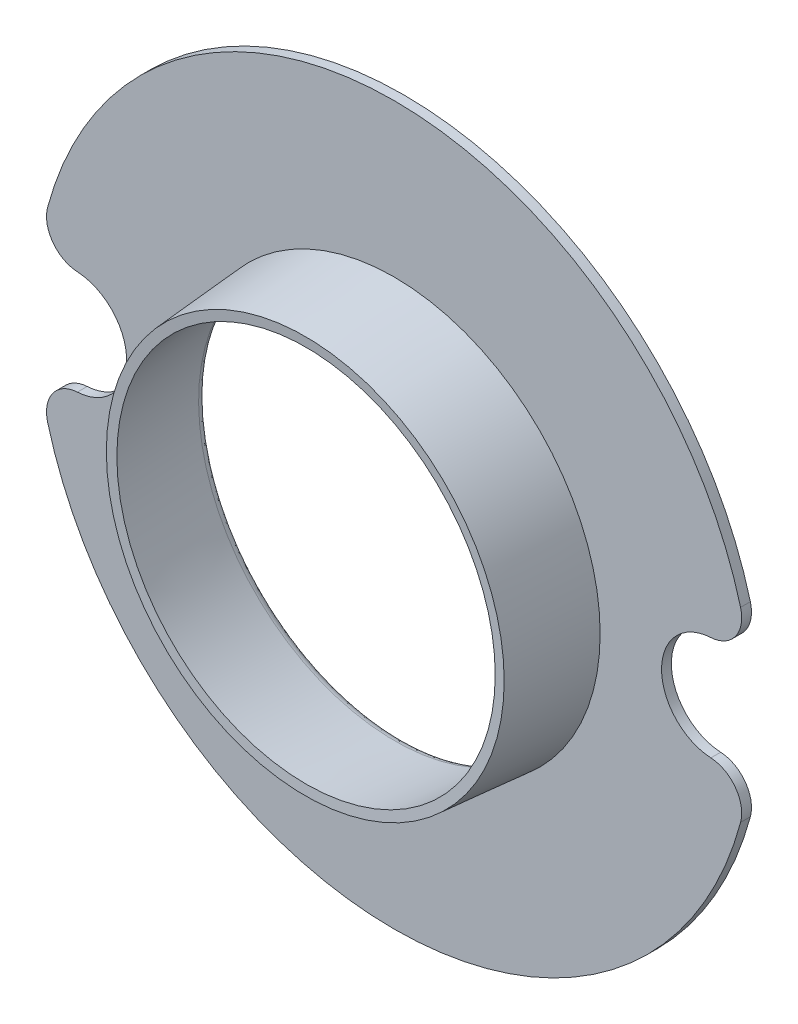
ISO-10303-21;
HEADER;
FILE_DESCRIPTION(('STEP AP214'),'2;1');
FILE_NAME('part.step','',(''),(''),'','','');
FILE_SCHEMA(('AUTOMOTIVE_DESIGN { 1 0 10303 214 1 1 1 1 }'));
ENDSEC;
DATA;
#1=APPLICATION_CONTEXT('core data for automotive mechanical design processes');
#2=APPLICATION_PROTOCOL_DEFINITION('international standard','automotive_design',2000,#1);
#3=PRODUCT_CONTEXT('',#1,'mechanical');
#4=PRODUCT('Part','Part','',(#3));
#5=PRODUCT_RELATED_PRODUCT_CATEGORY('part','',(#4));
#6=PRODUCT_DEFINITION_FORMATION('','',#4);
#7=PRODUCT_DEFINITION_CONTEXT('part definition',#1,'design');
#8=PRODUCT_DEFINITION('design','',#6,#7);
#9=PRODUCT_DEFINITION_SHAPE('','',#8);
#10=(LENGTH_UNIT() NAMED_UNIT(*) SI_UNIT(.MILLI.,.METRE.));
#11=(NAMED_UNIT(*) PLANE_ANGLE_UNIT() SI_UNIT($,.RADIAN.));
#12=(NAMED_UNIT(*) SI_UNIT($,.STERADIAN.) SOLID_ANGLE_UNIT());
#13=UNCERTAINTY_MEASURE_WITH_UNIT(LENGTH_MEASURE(1.E-05),#10,'distance_accuracy_value','');
#14=(GEOMETRIC_REPRESENTATION_CONTEXT(3) GLOBAL_UNCERTAINTY_ASSIGNED_CONTEXT((#13)) GLOBAL_UNIT_ASSIGNED_CONTEXT((#10,
#11,#12)) REPRESENTATION_CONTEXT('',''));
#15=CARTESIAN_POINT('',(0.,0.,0.));
#16=DIRECTION('',(0.,0.,1.));
#17=DIRECTION('',(1.,0.,0.));
#18=AXIS2_PLACEMENT_3D('',#15,#16,#17);
#19=CARTESIAN_POINT('',(0.,0.,21.0119617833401));
#20=DIRECTION('',(0.,0.,-1.));
#21=DIRECTION('',(-1.,0.,0.));
#22=AXIS2_PLACEMENT_3D('',#19,#20,#21);
#23=CONICAL_SURFACE('',#22,3.04952229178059,0.0798299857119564);
#24=CARTESIAN_POINT('',(0.,0.,21.0119617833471));
#25=DIRECTION('',(0.,0.,-1.));
#26=DIRECTION('',(1.,0.,0.));
#27=AXIS2_PLACEMENT_3D('',#24,#25,#26);
#28=CIRCLE('',#27,3.04952229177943);
#29=CARTESIAN_POINT('',(3.04952229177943,0.,21.0119617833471));
#30=VERTEX_POINT('',#29);
#31=EDGE_CURVE('E96',#30,#30,#28,.T.);
#32=ORIENTED_EDGE('',*,*,#31,.T.);
#33=EDGE_LOOP('',(#32));
#34=FACE_BOUND('',#33,.T.);
#35=CARTESIAN_POINT('',(0.,0.,19.65));
#36=DIRECTION('',(0.,0.,-1.));
#37=DIRECTION('',(-1.,0.,0.));
#38=AXIS2_PLACEMENT_3D('',#35,#36,#37);
#39=CIRCLE('',#38,3.15847923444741);
#40=CARTESIAN_POINT('',(-3.15847923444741,0.,19.65));
#41=VERTEX_POINT('',#40);
#42=EDGE_CURVE('E95',#41,#41,#39,.F.);
#43=ORIENTED_EDGE('',*,*,#42,.T.);
#44=EDGE_LOOP('',(#43));
#45=FACE_BOUND('',#44,.T.);
#46=ADVANCED_FACE('F16',(#34,#45),#23,.T.);
#47=CARTESIAN_POINT('',(0.,0.,21.0119617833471));
#48=DIRECTION('',(0.,0.,1.));
#49=DIRECTION('',(1.,0.,0.));
#50=AXIS2_PLACEMENT_3D('',#47,#48,#49);
#51=CONICAL_SURFACE('',#50,3.04952229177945,1.49096634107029);
#52=CARTESIAN_POINT('',(0.,0.,21.));
#53=DIRECTION('',(0.,0.,-1.));
#54=DIRECTION('',(1.,0.,0.));
#55=AXIS2_PLACEMENT_3D('',#52,#53,#54);
#56=CIRCLE('',#55,2.89999999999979);
#57=CARTESIAN_POINT('',(2.89999999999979,0.,21.));
#58=VERTEX_POINT('',#57);
#59=EDGE_CURVE('E139',#58,#58,#56,.T.);
#60=ORIENTED_EDGE('',*,*,#59,.T.);
#61=EDGE_LOOP('',(#60));
#62=FACE_BOUND('',#61,.T.);
#63=ORIENTED_EDGE('',*,*,#31,.F.);
#64=EDGE_LOOP('',(#63));
#65=FACE_BOUND('',#64,.T.);
#66=ADVANCED_FACE('F190',(#62,#65),#51,.F.);
#67=CARTESIAN_POINT('',(-5.541827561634,5.72,19.65));
#68=DIRECTION('',(0.,0.,-1.));
#69=DIRECTION('',(1.,0.,0.));
#70=AXIS2_PLACEMENT_3D('',#67,#68,#69);
#71=PLANE('',#70);
#72=ORIENTED_EDGE('',*,*,#42,.F.);
#73=EDGE_LOOP('',(#72));
#74=FACE_BOUND('',#73,.T.);
#75=CARTESIAN_POINT('',(4.9,0.,19.65));
#76=DIRECTION('',(0.,0.,1.));
#77=DIRECTION('',(1.,0.,0.));
#78=AXIS2_PLACEMENT_3D('',#75,#76,#77);
#79=CIRCLE('',#78,0.799999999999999);
#80=CARTESIAN_POINT('',(4.85604395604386,-0.798791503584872,19.65));
#81=VERTEX_POINT('',#80);
#82=CARTESIAN_POINT('',(4.85604395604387,0.798791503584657,19.65));
#83=VERTEX_POINT('',#82);
#84=EDGE_CURVE('E99',#81,#83,#79,.F.);
#85=ORIENTED_EDGE('',*,*,#84,.T.);
#86=CARTESIAN_POINT('',(4.828571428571,1.298036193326,19.65));
#87=DIRECTION('',(0.,0.,-1.));
#88=DIRECTION('',(0.,1.,0.));
#89=AXIS2_PLACEMENT_3D('',#86,#87,#88);
#90=CIRCLE('',#89,0.500000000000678);
#91=CARTESIAN_POINT('',(5.31142857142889,1.42783981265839,19.65));
#92=VERTEX_POINT('',#91);
#93=EDGE_CURVE('E84',#92,#83,#90,.T.);
#94=ORIENTED_EDGE('',*,*,#93,.F.);
#95=CARTESIAN_POINT('',(0.,0.,19.65));
#96=DIRECTION('',(0.,0.,-1.));
#97=DIRECTION('',(0.,1.,0.));
#98=AXIS2_PLACEMENT_3D('',#95,#96,#97);
#99=CIRCLE('',#98,5.5);
#100=CARTESIAN_POINT('',(-5.31142857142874,1.42783981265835,19.65));
#101=VERTEX_POINT('',#100);
#102=EDGE_CURVE('E142',#92,#101,#99,.F.);
#103=ORIENTED_EDGE('',*,*,#102,.T.);
#104=CARTESIAN_POINT('',(-4.828571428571,1.298036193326,19.65));
#105=DIRECTION('',(0.,0.,1.));
#106=DIRECTION('',(1.,0.,0.));
#107=AXIS2_PLACEMENT_3D('',#104,#105,#106);
#108=CIRCLE('',#107,0.500000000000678);
#109=CARTESIAN_POINT('',(-4.85604395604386,0.798791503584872,19.65));
#110=VERTEX_POINT('',#109);
#111=EDGE_CURVE('E135',#101,#110,#108,.T.);
#112=ORIENTED_EDGE('',*,*,#111,.T.);
#113=CARTESIAN_POINT('',(-4.9,0.,19.65));
#114=DIRECTION('',(0.,0.,-1.));
#115=DIRECTION('',(0.,1.,0.));
#116=AXIS2_PLACEMENT_3D('',#113,#114,#115);
#117=CIRCLE('',#116,0.799999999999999);
#118=CARTESIAN_POINT('',(-4.85604395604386,-0.798791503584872,19.65));
#119=VERTEX_POINT('',#118);
#120=EDGE_CURVE('E128',#110,#119,#117,.T.);
#121=ORIENTED_EDGE('',*,*,#120,.T.);
#122=CARTESIAN_POINT('',(-4.828571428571,-1.298036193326,19.65));
#123=DIRECTION('',(0.,0.,-1.));
#124=DIRECTION('',(0.,1.,0.));
#125=AXIS2_PLACEMENT_3D('',#122,#123,#124);
#126=CIRCLE('',#125,0.500000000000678);
#127=CARTESIAN_POINT('',(-5.31142857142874,-1.42783981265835,19.65));
#128=VERTEX_POINT('',#127);
#129=EDGE_CURVE('E127',#119,#128,#126,.F.);
#130=ORIENTED_EDGE('',*,*,#129,.T.);
#131=CARTESIAN_POINT('',(0.,0.,19.65));
#132=DIRECTION('',(0.,0.,-1.));
#133=DIRECTION('',(0.,1.,0.));
#134=AXIS2_PLACEMENT_3D('',#131,#132,#133);
#135=CIRCLE('',#134,5.5);
#136=CARTESIAN_POINT('',(5.31142857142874,-1.42783981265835,19.65));
#137=VERTEX_POINT('',#136);
#138=EDGE_CURVE('E123',#128,#137,#135,.F.);
#139=ORIENTED_EDGE('',*,*,#138,.T.);
#140=CARTESIAN_POINT('',(4.828571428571,-1.298036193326,19.65));
#141=DIRECTION('',(0.,0.,1.));
#142=DIRECTION('',(1.,0.,0.));
#143=AXIS2_PLACEMENT_3D('',#140,#141,#142);
#144=CIRCLE('',#143,0.500000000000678);
#145=EDGE_CURVE('E102',#137,#81,#144,.T.);
#146=ORIENTED_EDGE('',*,*,#145,.T.);
#147=EDGE_LOOP('',(#85,#94,#103,#112,#121,#130,#139,#146));
#148=FACE_BOUND('',#147,.T.);
#149=ADVANCED_FACE('F100',(#74,#148),#71,.F.);
#150=CARTESIAN_POINT('',(0.,0.,21.));
#151=DIRECTION('',(0.,0.,-1.));
#152=DIRECTION('',(-1.,0.,0.));
#153=AXIS2_PLACEMENT_3D('',#150,#151,#152);
#154=CONICAL_SURFACE('',#153,2.89999999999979,0.0798299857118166);
#155=ORIENTED_EDGE('',*,*,#59,.F.);
#156=EDGE_LOOP('',(#155));
#157=FACE_BOUND('',#156,.T.);
#158=CARTESIAN_POINT('',(0.,0.,19.63803822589));
#159=DIRECTION('',(0.,0.,-1.));
#160=DIRECTION('',(-0.999963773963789,-0.00851180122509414,0.));
#161=AXIS2_PLACEMENT_3D('',#158,#159,#160);
#162=CIRCLE('',#161,3.0089569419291);
#163=CARTESIAN_POINT('',(-3.00884793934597,-0.0256116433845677,19.63803822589));
#164=VERTEX_POINT('',#163);
#165=EDGE_CURVE('E112',#164,#164,#162,.T.);
#166=ORIENTED_EDGE('',*,*,#165,.T.);
#167=EDGE_LOOP('',(#166));
#168=FACE_BOUND('',#167,.T.);
#169=ADVANCED_FACE('F189',(#157,#168),#154,.F.);
#170=CARTESIAN_POINT('',(0.,0.,19.65));
#171=DIRECTION('',(0.,0.,-1.));
#172=DIRECTION('',(0.,1.,0.));
#173=AXIS2_PLACEMENT_3D('',#170,#171,#172);
#174=CYLINDRICAL_SURFACE('',#173,5.5);
#175=CARTESIAN_POINT('',(0.,0.,19.5));
#176=DIRECTION('',(0.,0.,-1.));
#177=DIRECTION('',(0.,1.,0.));
#178=AXIS2_PLACEMENT_3D('',#175,#176,#177);
#179=CIRCLE('',#178,5.5);
#180=CARTESIAN_POINT('',(5.31142857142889,1.42783981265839,19.5));
#181=VERTEX_POINT('',#180);
#182=CARTESIAN_POINT('',(-5.31142857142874,1.42783981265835,19.5));
#183=VERTEX_POINT('',#182);
#184=EDGE_CURVE('E138',#181,#183,#179,.F.);
#185=ORIENTED_EDGE('',*,*,#184,.T.);
#186=DIRECTION('',(0.,0.,1.));
#187=VECTOR('',#186,1.);
#188=CARTESIAN_POINT('',(-5.311428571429,1.427839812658,19.575));
#189=LINE('',#188,#187);
#190=EDGE_CURVE('E132',#183,#101,#189,.T.);
#191=ORIENTED_EDGE('',*,*,#190,.T.);
#192=ORIENTED_EDGE('',*,*,#102,.F.);
#193=DIRECTION('',(0.,0.,-1.));
#194=VECTOR('',#193,1.);
#195=CARTESIAN_POINT('',(5.311428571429,1.427839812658,19.575));
#196=LINE('',#195,#194);
#197=EDGE_CURVE('E94',#92,#181,#196,.T.);
#198=ORIENTED_EDGE('',*,*,#197,.T.);
#199=EDGE_LOOP('',(#185,#191,#192,#198));
#200=FACE_BOUND('',#199,.T.);
#201=ADVANCED_FACE('F196',(#200),#174,.T.);
#202=CARTESIAN_POINT('',(-4.828571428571,1.298036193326,19.5));
#203=DIRECTION('',(0.,0.,1.));
#204=DIRECTION('',(1.,0.,0.));
#205=AXIS2_PLACEMENT_3D('',#202,#203,#204);
#206=CYLINDRICAL_SURFACE('',#205,0.500000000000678);
#207=CARTESIAN_POINT('',(-4.828571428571,1.298036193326,19.5));
#208=DIRECTION('',(0.,0.,1.));
#209=DIRECTION('',(1.,0.,0.));
#210=AXIS2_PLACEMENT_3D('',#207,#208,#209);
#211=CIRCLE('',#210,0.500000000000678);
#212=CARTESIAN_POINT('',(-4.85604395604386,0.798791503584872,19.5));
#213=VERTEX_POINT('',#212);
#214=EDGE_CURVE('E175',#183,#213,#211,.T.);
#215=ORIENTED_EDGE('',*,*,#214,.T.);
#216=DIRECTION('',(0.,0.,-1.));
#217=VECTOR('',#216,1.);
#218=CARTESIAN_POINT('',(-4.856043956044,0.798791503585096,19.575));
#219=LINE('',#218,#217);
#220=EDGE_CURVE('E129',#213,#110,#219,.F.);
#221=ORIENTED_EDGE('',*,*,#220,.T.);
#222=ORIENTED_EDGE('',*,*,#111,.F.);
#223=ORIENTED_EDGE('',*,*,#190,.F.);
#224=EDGE_LOOP('',(#215,#221,#222,#223));
#225=FACE_BOUND('',#224,.T.);
#226=ADVANCED_FACE('F217',(#225),#206,.T.);
#227=CARTESIAN_POINT('',(-4.9,0.,19.65));
#228=DIRECTION('',(0.,0.,-1.));
#229=DIRECTION('',(0.,1.,0.));
#230=AXIS2_PLACEMENT_3D('',#227,#228,#229);
#231=CYLINDRICAL_SURFACE('',#230,0.799999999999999);
#232=DIRECTION('',(0.,0.,1.));
#233=VECTOR('',#232,1.);
#234=CARTESIAN_POINT('',(-4.85604395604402,-0.798791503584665,19.575));
#235=LINE('',#234,#233);
#236=CARTESIAN_POINT('',(-4.85604395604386,-0.798791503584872,19.5));
#237=VERTEX_POINT('',#236);
#238=EDGE_CURVE('E124',#237,#119,#235,.T.);
#239=ORIENTED_EDGE('',*,*,#238,.T.);
#240=ORIENTED_EDGE('',*,*,#120,.F.);
#241=ORIENTED_EDGE('',*,*,#220,.F.);
#242=CARTESIAN_POINT('',(-4.9,0.,19.5));
#243=DIRECTION('',(0.,0.,-1.));
#244=DIRECTION('',(0.,1.,0.));
#245=AXIS2_PLACEMENT_3D('',#242,#243,#244);
#246=CIRCLE('',#245,0.799999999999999);
#247=EDGE_CURVE('E173',#213,#237,#246,.T.);
#248=ORIENTED_EDGE('',*,*,#247,.T.);
#249=EDGE_LOOP('',(#239,#240,#241,#248));
#250=FACE_BOUND('',#249,.T.);
#251=ADVANCED_FACE('F223',(#250),#231,.F.);
#252=CARTESIAN_POINT('',(-4.828571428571,-1.298036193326,19.65));
#253=DIRECTION('',(0.,0.,-1.));
#254=DIRECTION('',(0.,1.,0.));
#255=AXIS2_PLACEMENT_3D('',#252,#253,#254);
#256=CYLINDRICAL_SURFACE('',#255,0.500000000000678);
#257=ORIENTED_EDGE('',*,*,#129,.F.);
#258=ORIENTED_EDGE('',*,*,#238,.F.);
#259=CARTESIAN_POINT('',(-4.828571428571,-1.298036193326,19.5));
#260=DIRECTION('',(0.,0.,-1.));
#261=DIRECTION('',(0.,1.,0.));
#262=AXIS2_PLACEMENT_3D('',#259,#260,#261);
#263=CIRCLE('',#262,0.500000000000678);
#264=CARTESIAN_POINT('',(-5.31142857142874,-1.42783981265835,19.5));
#265=VERTEX_POINT('',#264);
#266=EDGE_CURVE('E171',#237,#265,#263,.F.);
#267=ORIENTED_EDGE('',*,*,#266,.T.);
#268=DIRECTION('',(0.,0.,1.));
#269=VECTOR('',#268,1.);
#270=CARTESIAN_POINT('',(-5.31142857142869,-1.42783981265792,19.575));
#271=LINE('',#270,#269);
#272=EDGE_CURVE('E120',#265,#128,#271,.T.);
#273=ORIENTED_EDGE('',*,*,#272,.T.);
#274=EDGE_LOOP('',(#257,#258,#267,#273));
#275=FACE_BOUND('',#274,.T.);
#276=ADVANCED_FACE('F226',(#275),#256,.T.);
#277=CARTESIAN_POINT('',(0.,0.,19.65));
#278=DIRECTION('',(0.,0.,-1.));
#279=DIRECTION('',(0.,1.,0.));
#280=AXIS2_PLACEMENT_3D('',#277,#278,#279);
#281=CYLINDRICAL_SURFACE('',#280,5.5);
#282=CARTESIAN_POINT('',(0.,0.,19.5));
#283=DIRECTION('',(0.,0.,-1.));
#284=DIRECTION('',(0.,1.,0.));
#285=AXIS2_PLACEMENT_3D('',#282,#283,#284);
#286=CIRCLE('',#285,5.5);
#287=CARTESIAN_POINT('',(5.31142857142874,-1.42783981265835,19.5));
#288=VERTEX_POINT('',#287);
#289=EDGE_CURVE('E169',#265,#288,#286,.F.);
#290=ORIENTED_EDGE('',*,*,#289,.T.);
#291=DIRECTION('',(0.,0.,1.));
#292=VECTOR('',#291,1.);
#293=CARTESIAN_POINT('',(5.311428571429,-1.427839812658,19.575));
#294=LINE('',#293,#292);
#295=EDGE_CURVE('E117',#288,#137,#294,.T.);
#296=ORIENTED_EDGE('',*,*,#295,.T.);
#297=ORIENTED_EDGE('',*,*,#138,.F.);
#298=ORIENTED_EDGE('',*,*,#272,.F.);
#299=EDGE_LOOP('',(#290,#296,#297,#298));
#300=FACE_BOUND('',#299,.T.);
#301=ADVANCED_FACE('F230',(#300),#281,.T.);
#302=CARTESIAN_POINT('',(4.828571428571,-1.298036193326,19.5));
#303=DIRECTION('',(0.,0.,1.));
#304=DIRECTION('',(1.,0.,0.));
#305=AXIS2_PLACEMENT_3D('',#302,#303,#304);
#306=CYLINDRICAL_SURFACE('',#305,0.500000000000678);
#307=CARTESIAN_POINT('',(4.828571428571,-1.298036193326,19.5));
#308=DIRECTION('',(0.,0.,1.));
#309=DIRECTION('',(1.,0.,0.));
#310=AXIS2_PLACEMENT_3D('',#307,#308,#309);
#311=CIRCLE('',#310,0.500000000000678);
#312=CARTESIAN_POINT('',(4.85604395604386,-0.798791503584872,19.5));
#313=VERTEX_POINT('',#312);
#314=EDGE_CURVE('E167',#288,#313,#311,.T.);
#315=ORIENTED_EDGE('',*,*,#314,.T.);
#316=DIRECTION('',(0.,0.,-1.));
#317=VECTOR('',#316,1.);
#318=CARTESIAN_POINT('',(4.856043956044,-0.798791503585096,19.575));
#319=LINE('',#318,#317);
#320=EDGE_CURVE('E106',#313,#81,#319,.F.);
#321=ORIENTED_EDGE('',*,*,#320,.T.);
#322=ORIENTED_EDGE('',*,*,#145,.F.);
#323=ORIENTED_EDGE('',*,*,#295,.F.);
#324=EDGE_LOOP('',(#315,#321,#322,#323));
#325=FACE_BOUND('',#324,.T.);
#326=ADVANCED_FACE('F233',(#325),#306,.T.);
#327=CARTESIAN_POINT('',(4.9,0.,19.5));
#328=DIRECTION('',(0.,0.,1.));
#329=DIRECTION('',(1.,0.,0.));
#330=AXIS2_PLACEMENT_3D('',#327,#328,#329);
#331=CYLINDRICAL_SURFACE('',#330,0.799999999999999);
#332=ORIENTED_EDGE('',*,*,#320,.F.);
#333=CARTESIAN_POINT('',(4.9,0.,19.5));
#334=DIRECTION('',(0.,0.,1.));
#335=DIRECTION('',(1.,0.,0.));
#336=AXIS2_PLACEMENT_3D('',#333,#334,#335);
#337=CIRCLE('',#336,0.799999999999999);
#338=CARTESIAN_POINT('',(4.85604395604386,0.798791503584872,19.5));
#339=VERTEX_POINT('',#338);
#340=EDGE_CURVE('E110',#313,#339,#337,.F.);
#341=ORIENTED_EDGE('',*,*,#340,.T.);
#342=DIRECTION('',(0.,0.,1.));
#343=VECTOR('',#342,1.);
#344=CARTESIAN_POINT('',(4.85604395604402,0.798791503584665,19.575));
#345=LINE('',#344,#343);
#346=EDGE_CURVE('E92',#339,#83,#345,.T.);
#347=ORIENTED_EDGE('',*,*,#346,.T.);
#348=ORIENTED_EDGE('',*,*,#84,.F.);
#349=EDGE_LOOP('',(#332,#341,#347,#348));
#350=FACE_BOUND('',#349,.T.);
#351=ADVANCED_FACE('F108',(#350),#331,.F.);
#352=CARTESIAN_POINT('',(4.828571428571,1.298036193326,19.65));
#353=DIRECTION('',(0.,0.,-1.));
#354=DIRECTION('',(0.,1.,0.));
#355=AXIS2_PLACEMENT_3D('',#352,#353,#354);
#356=CYLINDRICAL_SURFACE('',#355,0.500000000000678);
#357=ORIENTED_EDGE('',*,*,#93,.T.);
#358=ORIENTED_EDGE('',*,*,#346,.F.);
#359=CARTESIAN_POINT('',(4.828571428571,1.298036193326,19.5));
#360=DIRECTION('',(0.,0.,-1.));
#361=DIRECTION('',(0.,1.,0.));
#362=AXIS2_PLACEMENT_3D('',#359,#360,#361);
#363=CIRCLE('',#362,0.500000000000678);
#364=EDGE_CURVE('E159',#339,#181,#363,.F.);
#365=ORIENTED_EDGE('',*,*,#364,.T.);
#366=ORIENTED_EDGE('',*,*,#197,.F.);
#367=EDGE_LOOP('',(#357,#358,#365,#366));
#368=FACE_BOUND('',#367,.T.);
#369=ADVANCED_FACE('F89',(#368),#356,.T.);
#370=CARTESIAN_POINT('',(-3.17707368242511,-0.0270435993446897,19.5011713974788));
#371=CARTESIAN_POINT('',(-3.07763276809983,-0.0261971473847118,19.4886700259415));
#372=CARTESIAN_POINT('',(-3.00399245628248,-0.0255703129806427,19.5566568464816));
#373=CARTESIAN_POINT('',(-3.00852362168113,-0.0256088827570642,19.6567815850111));
#374=(BOUNDED_CURVE() B_SPLINE_CURVE(3,(#370,#371,#372,#373),.UNSPECIFIED.,.F.,
.F.) B_SPLINE_CURVE_WITH_KNOTS((4,4),(0.,1.),
.UNSPECIFIED.) CURVE() GEOMETRIC_REPRESENTATION_ITEM() RATIONAL_B_SPLINE_CURVE((1.,
0.762942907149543,0.762942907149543,1.)) REPRESENTATION_ITEM(''));
#375=CARTESIAN_POINT('',(0.,0.,19.65));
#376=DIRECTION('',(0.,0.,-1.));
#377=AXIS1_PLACEMENT('',#375,#376);
#378=SURFACE_OF_REVOLUTION('',#374,#377);
#379=CARTESIAN_POINT('',(0.,0.,19.5));
#380=DIRECTION('',(0.,0.,-1.));
#381=DIRECTION('',(-1.,-1.90841522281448E-13,0.));
#382=AXIS2_PLACEMENT_3D('',#379,#380,#381);
#383=CIRCLE('',#382,3.15847917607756);
#384=CARTESIAN_POINT('',(-3.15847915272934,-3.62214943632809E-13,19.5));
#385=VERTEX_POINT('',#384);
#386=CARTESIAN_POINT('',(3.15847915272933,3.61915411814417E-13,19.5));
#387=VERTEX_POINT('',#386);
#388=EDGE_CURVE('E11',#385,#387,#383,.T.);
#389=ORIENTED_EDGE('',*,*,#388,.T.);
#390=CARTESIAN_POINT('',(0.,0.,19.5));
#391=DIRECTION('',(0.,0.,-1.));
#392=DIRECTION('',(1.,1.90830795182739E-13,0.));
#393=AXIS2_PLACEMENT_3D('',#390,#391,#392);
#394=CIRCLE('',#393,3.15847917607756);
#395=EDGE_CURVE('E29',#387,#385,#394,.T.);
#396=ORIENTED_EDGE('',*,*,#395,.T.);
#397=EDGE_LOOP('',(#389,#396));
#398=FACE_BOUND('',#397,.T.);
#399=ORIENTED_EDGE('',*,*,#165,.F.);
#400=EDGE_LOOP('',(#399));
#401=FACE_BOUND('',#400,.T.);
#402=ADVANCED_FACE('F203',(#398,#401),#378,.T.);
#403=CARTESIAN_POINT('',(-5.541827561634,5.72,19.5));
#404=DIRECTION('',(0.,0.,-1.));
#405=DIRECTION('',(1.,0.,0.));
#406=AXIS2_PLACEMENT_3D('',#403,#404,#405);
#407=PLANE('',#406);
#408=ORIENTED_EDGE('',*,*,#395,.F.);
#409=ORIENTED_EDGE('',*,*,#388,.F.);
#410=EDGE_LOOP('',(#408,#409));
#411=FACE_BOUND('',#410,.T.);
#412=ORIENTED_EDGE('',*,*,#340,.F.);
#413=ORIENTED_EDGE('',*,*,#314,.F.);
#414=ORIENTED_EDGE('',*,*,#289,.F.);
#415=ORIENTED_EDGE('',*,*,#266,.F.);
#416=ORIENTED_EDGE('',*,*,#247,.F.);
#417=ORIENTED_EDGE('',*,*,#214,.F.);
#418=ORIENTED_EDGE('',*,*,#184,.F.);
#419=ORIENTED_EDGE('',*,*,#364,.F.);
#420=EDGE_LOOP('',(#412,#413,#414,#415,#416,#417,#418,#419));
#421=FACE_BOUND('',#420,.T.);
#422=ADVANCED_FACE('F18',(#411,#421),#407,.T.);
#423=CLOSED_SHELL('',(#46,#66,#149,#169,#201,#226,#251,#276,#301,#326,#351,#369,#402,#422));
#424=MANIFOLD_SOLID_BREP('B1',#423);
#425=ADVANCED_BREP_SHAPE_REPRESENTATION('',(#18,#424),#14);
#426=SHAPE_DEFINITION_REPRESENTATION(#9,#425);
ENDSEC;
END-ISO-10303-21;
